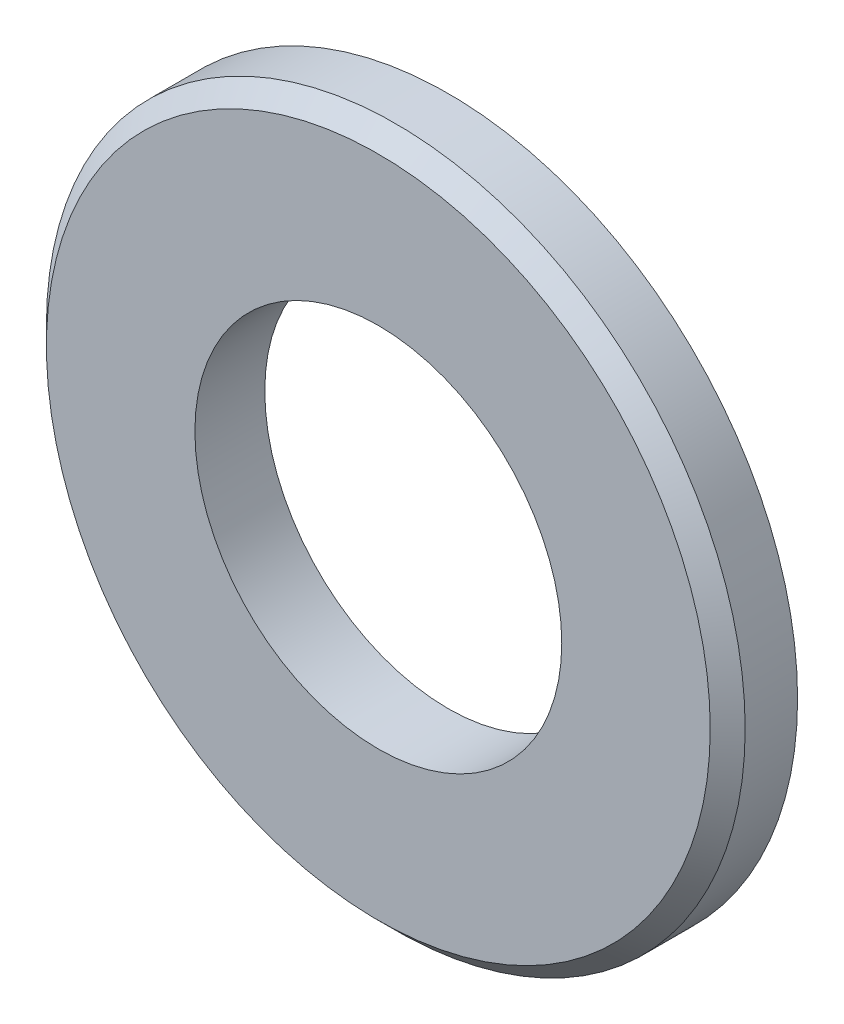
from build123d import *

# Parameters (mm, degrees)
SKETCH1_R          = 8
SKETCH1_R_2        = 4.2
BASE_EXTRUDE_DEPTH = 1.6
CHAMFER1_SIZE      = 0.4


with BuildPart() as part:
    # Sketch1 → Base-Extrude (new body)
    with BuildSketch(Plane.XY):
        Circle(SKETCH1_R)
        Circle(SKETCH1_R_2, mode=Mode.SUBTRACT)
    extrude(amount=-BASE_EXTRUDE_DEPTH)

    # Chamfer1
    chamfer1_edges = [part.edges().sort_by_distance(p)[0] for p in [
        (-8, 0, 0),
    ]]
    chamfer(chamfer1_edges, length=CHAMFER1_SIZE)


solid = part.part
